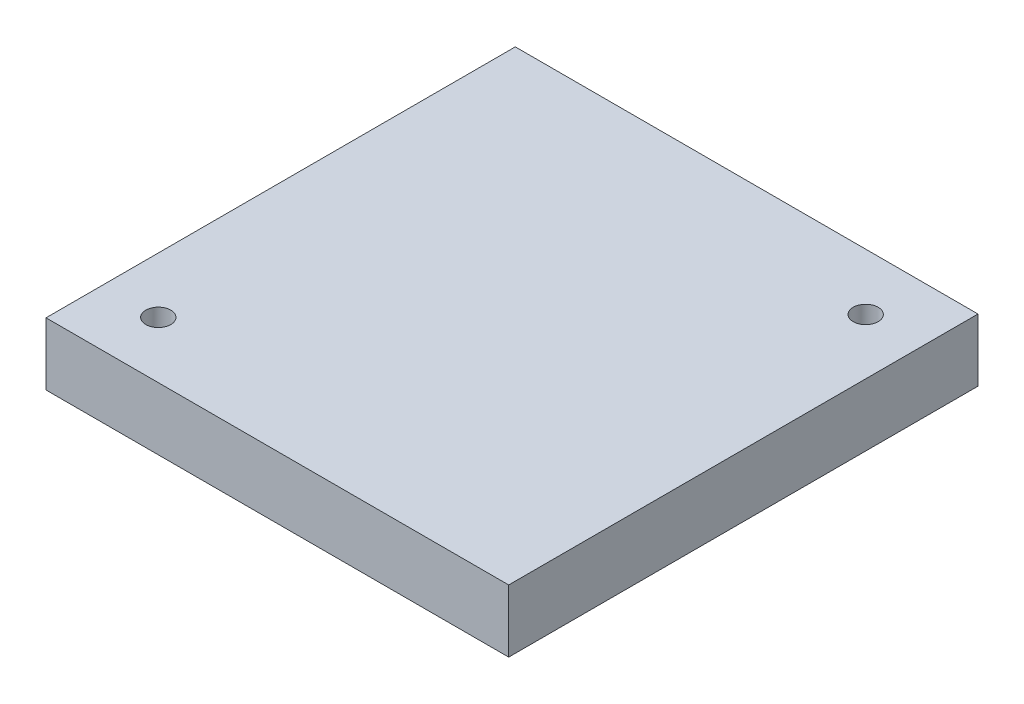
ISO-10303-21;
HEADER;
FILE_DESCRIPTION(('STEP AP214'),'2;1');
FILE_NAME('part.step','',(''),(''),'','','');
FILE_SCHEMA(('AUTOMOTIVE_DESIGN { 1 0 10303 214 1 1 1 1 }'));
ENDSEC;
DATA;
#1=APPLICATION_CONTEXT('core data for automotive mechanical design processes');
#2=APPLICATION_PROTOCOL_DEFINITION('international standard','automotive_design',2000,#1);
#3=PRODUCT_CONTEXT('',#1,'mechanical');
#4=PRODUCT('Part','Part','',(#3));
#5=PRODUCT_RELATED_PRODUCT_CATEGORY('part','',(#4));
#6=PRODUCT_DEFINITION_FORMATION('','',#4);
#7=PRODUCT_DEFINITION_CONTEXT('part definition',#1,'design');
#8=PRODUCT_DEFINITION('design','',#6,#7);
#9=PRODUCT_DEFINITION_SHAPE('','',#8);
#10=(LENGTH_UNIT() NAMED_UNIT(*) SI_UNIT(.MILLI.,.METRE.));
#11=(NAMED_UNIT(*) PLANE_ANGLE_UNIT() SI_UNIT($,.RADIAN.));
#12=(NAMED_UNIT(*) SI_UNIT($,.STERADIAN.) SOLID_ANGLE_UNIT());
#13=UNCERTAINTY_MEASURE_WITH_UNIT(LENGTH_MEASURE(1.E-05),#10,'distance_accuracy_value','');
#14=(GEOMETRIC_REPRESENTATION_CONTEXT(3) GLOBAL_UNCERTAINTY_ASSIGNED_CONTEXT((#13)) GLOBAL_UNIT_ASSIGNED_CONTEXT((#10,
#11,#12)) REPRESENTATION_CONTEXT('',''));
#15=CARTESIAN_POINT('',(0.,0.,0.));
#16=DIRECTION('',(0.,0.,1.));
#17=DIRECTION('',(1.,0.,0.));
#18=AXIS2_PLACEMENT_3D('',#15,#16,#17);
#19=CARTESIAN_POINT('',(0.,0.,0.));
#20=DIRECTION('',(0.,-1.,0.));
#21=DIRECTION('',(0.,0.,-1.));
#22=AXIS2_PLACEMENT_3D('',#19,#20,#21);
#23=PLANE('',#22);
#24=DIRECTION('',(0.,0.,-1.));
#25=VECTOR('',#24,1.);
#26=CARTESIAN_POINT('',(18.5,0.,18.7638837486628));
#27=LINE('',#26,#25);
#28=CARTESIAN_POINT('',(18.5,0.,18.7638837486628));
#29=VERTEX_POINT('',#28);
#30=CARTESIAN_POINT('',(18.5,0.,-18.7638837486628));
#31=VERTEX_POINT('',#30);
#32=EDGE_CURVE('E148',#29,#31,#27,.T.);
#33=ORIENTED_EDGE('',*,*,#32,.F.);
#34=DIRECTION('',(1.,0.,0.));
#35=VECTOR('',#34,1.);
#36=CARTESIAN_POINT('',(-18.5,0.,18.7638837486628));
#37=LINE('',#36,#35);
#38=CARTESIAN_POINT('',(-18.5,0.,18.7638837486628));
#39=VERTEX_POINT('',#38);
#40=EDGE_CURVE('E158',#39,#29,#37,.T.);
#41=ORIENTED_EDGE('',*,*,#40,.F.);
#42=DIRECTION('',(0.,0.,1.));
#43=VECTOR('',#42,1.);
#44=CARTESIAN_POINT('',(-18.5,0.,18.7638837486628));
#45=LINE('',#44,#43);
#46=CARTESIAN_POINT('',(-18.5,0.,-18.7638837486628));
#47=VERTEX_POINT('',#46);
#48=EDGE_CURVE('E155',#47,#39,#45,.T.);
#49=ORIENTED_EDGE('',*,*,#48,.F.);
#50=DIRECTION('',(-1.,0.,0.));
#51=VECTOR('',#50,1.);
#52=CARTESIAN_POINT('',(-18.5,0.,-18.7638837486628));
#53=LINE('',#52,#51);
#54=EDGE_CURVE('E152',#31,#47,#53,.T.);
#55=ORIENTED_EDGE('',*,*,#54,.F.);
#56=EDGE_LOOP('',(#33,#41,#49,#55));
#57=FACE_BOUND('',#56,.T.);
#58=DIRECTION('',(1.,0.,0.));
#59=VECTOR('',#58,1.);
#60=CARTESIAN_POINT('',(0.,0.,16.7638837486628));
#61=LINE('',#60,#59);
#62=CARTESIAN_POINT('',(-16.5,0.,16.7638837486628));
#63=VERTEX_POINT('',#62);
#64=CARTESIAN_POINT('',(16.5,0.,16.7638837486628));
#65=VERTEX_POINT('',#64);
#66=EDGE_CURVE('E132',#63,#65,#61,.T.);
#67=ORIENTED_EDGE('',*,*,#66,.T.);
#68=DIRECTION('',(0.,0.,-1.));
#69=VECTOR('',#68,1.);
#70=CARTESIAN_POINT('',(16.5,0.,0.));
#71=LINE('',#70,#69);
#72=CARTESIAN_POINT('',(16.5,0.,-16.7638837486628));
#73=VERTEX_POINT('',#72);
#74=EDGE_CURVE('E137',#65,#73,#71,.T.);
#75=ORIENTED_EDGE('',*,*,#74,.T.);
#76=DIRECTION('',(-1.,0.,0.));
#77=VECTOR('',#76,1.);
#78=CARTESIAN_POINT('',(0.,0.,-16.7638837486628));
#79=LINE('',#78,#77);
#80=CARTESIAN_POINT('',(-16.5,0.,-16.7638837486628));
#81=VERTEX_POINT('',#80);
#82=EDGE_CURVE('E120',#73,#81,#79,.T.);
#83=ORIENTED_EDGE('',*,*,#82,.T.);
#84=DIRECTION('',(0.,0.,1.));
#85=VECTOR('',#84,1.);
#86=CARTESIAN_POINT('',(-16.5,0.,0.));
#87=LINE('',#86,#85);
#88=EDGE_CURVE('E50',#81,#63,#87,.T.);
#89=ORIENTED_EDGE('',*,*,#88,.T.);
#90=EDGE_LOOP('',(#67,#75,#83,#89));
#91=FACE_BOUND('',#90,.T.);
#92=ADVANCED_FACE('F33',(#57,#91),#23,.T.);
#93=CARTESIAN_POINT('',(18.5,14.,18.7638837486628));
#94=DIRECTION('',(-1.,0.,0.));
#95=DIRECTION('',(0.,0.,1.));
#96=AXIS2_PLACEMENT_3D('',#93,#94,#95);
#97=PLANE('',#96);
#98=DIRECTION('',(0.,-1.,0.));
#99=VECTOR('',#98,1.);
#100=CARTESIAN_POINT('',(18.5,14.,-18.7638837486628));
#101=LINE('',#100,#99);
#102=CARTESIAN_POINT('',(18.5,5.00000000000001,-18.7638837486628));
#103=VERTEX_POINT('',#102);
#104=EDGE_CURVE('E11',#103,#31,#101,.T.);
#105=ORIENTED_EDGE('',*,*,#104,.F.);
#106=DIRECTION('',(0.,0.,1.));
#107=VECTOR('',#106,1.);
#108=CARTESIAN_POINT('',(18.5,5.00000000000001,-18.7638837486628));
#109=LINE('',#108,#107);
#110=CARTESIAN_POINT('',(18.5,5.,18.7638837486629));
#111=VERTEX_POINT('',#110);
#112=EDGE_CURVE('E124',#103,#111,#109,.T.);
#113=ORIENTED_EDGE('',*,*,#112,.T.);
#114=DIRECTION('',(0.,-1.,0.));
#115=VECTOR('',#114,1.);
#116=CARTESIAN_POINT('',(18.5,14.,18.7638837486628));
#117=LINE('',#116,#115);
#118=EDGE_CURVE('E161',#111,#29,#117,.T.);
#119=ORIENTED_EDGE('',*,*,#118,.T.);
#120=ORIENTED_EDGE('',*,*,#32,.T.);
#121=EDGE_LOOP('',(#105,#113,#119,#120));
#122=FACE_BOUND('',#121,.T.);
#123=ADVANCED_FACE('F35',(#122),#97,.F.);
#124=CARTESIAN_POINT('',(-18.5,14.,-18.7638837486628));
#125=DIRECTION('',(0.,0.,1.));
#126=DIRECTION('',(1.,0.,0.));
#127=AXIS2_PLACEMENT_3D('',#124,#125,#126);
#128=PLANE('',#127);
#129=DIRECTION('',(0.,-1.,0.));
#130=VECTOR('',#129,1.);
#131=CARTESIAN_POINT('',(-18.5,14.,-18.7638837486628));
#132=LINE('',#131,#130);
#133=CARTESIAN_POINT('',(-18.5,5.00000000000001,-18.7638837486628));
#134=VERTEX_POINT('',#133);
#135=EDGE_CURVE('E42',#134,#47,#132,.T.);
#136=ORIENTED_EDGE('',*,*,#135,.F.);
#137=DIRECTION('',(-1.,0.,0.));
#138=VECTOR('',#137,1.);
#139=CARTESIAN_POINT('',(18.5,5.00000000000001,-18.7638837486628));
#140=LINE('',#139,#138);
#141=EDGE_CURVE('E144',#103,#134,#140,.T.);
#142=ORIENTED_EDGE('',*,*,#141,.F.);
#143=ORIENTED_EDGE('',*,*,#104,.T.);
#144=ORIENTED_EDGE('',*,*,#54,.T.);
#145=EDGE_LOOP('',(#136,#142,#143,#144));
#146=FACE_BOUND('',#145,.T.);
#147=ADVANCED_FACE('F199',(#146),#128,.F.);
#148=CARTESIAN_POINT('',(-18.5,14.,18.7638837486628));
#149=DIRECTION('',(1.,0.,0.));
#150=DIRECTION('',(0.,0.,-1.));
#151=AXIS2_PLACEMENT_3D('',#148,#149,#150);
#152=PLANE('',#151);
#153=DIRECTION('',(0.,-1.,0.));
#154=VECTOR('',#153,1.);
#155=CARTESIAN_POINT('',(-18.5,14.,18.7638837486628));
#156=LINE('',#155,#154);
#157=CARTESIAN_POINT('',(-18.5,5.,18.7638837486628));
#158=VERTEX_POINT('',#157);
#159=EDGE_CURVE('E163',#158,#39,#156,.T.);
#160=ORIENTED_EDGE('',*,*,#159,.F.);
#161=DIRECTION('',(0.,0.,1.));
#162=VECTOR('',#161,1.);
#163=CARTESIAN_POINT('',(-18.5,5.00000000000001,-18.7638837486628));
#164=LINE('',#163,#162);
#165=EDGE_CURVE('E58',#134,#158,#164,.T.);
#166=ORIENTED_EDGE('',*,*,#165,.F.);
#167=ORIENTED_EDGE('',*,*,#135,.T.);
#168=ORIENTED_EDGE('',*,*,#48,.T.);
#169=EDGE_LOOP('',(#160,#166,#167,#168));
#170=FACE_BOUND('',#169,.T.);
#171=ADVANCED_FACE('F189',(#170),#152,.F.);
#172=CARTESIAN_POINT('',(-18.5,14.,18.7638837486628));
#173=DIRECTION('',(0.,0.,-1.));
#174=DIRECTION('',(-1.,0.,0.));
#175=AXIS2_PLACEMENT_3D('',#172,#173,#174);
#176=PLANE('',#175);
#177=ORIENTED_EDGE('',*,*,#118,.F.);
#178=DIRECTION('',(-1.,0.,0.));
#179=VECTOR('',#178,1.);
#180=CARTESIAN_POINT('',(18.5,5.,18.7638837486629));
#181=LINE('',#180,#179);
#182=EDGE_CURVE('E146',#111,#158,#181,.T.);
#183=ORIENTED_EDGE('',*,*,#182,.T.);
#184=ORIENTED_EDGE('',*,*,#159,.T.);
#185=ORIENTED_EDGE('',*,*,#40,.T.);
#186=EDGE_LOOP('',(#177,#183,#184,#185));
#187=FACE_BOUND('',#186,.T.);
#188=ADVANCED_FACE('F181',(#187),#176,.F.);
#189=CARTESIAN_POINT('',(18.5,5.00000000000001,-18.7638837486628));
#190=DIRECTION('',(0.,-1.,0.));
#191=DIRECTION('',(0.,0.,-1.));
#192=AXIS2_PLACEMENT_3D('',#189,#190,#191);
#193=PLANE('',#192);
#194=CARTESIAN_POINT('',(-14.0416361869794,5.,14.2419258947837));
#195=DIRECTION('',(0.,1.,0.));
#196=DIRECTION('',(0.,0.,1.));
#197=AXIS2_PLACEMENT_3D('',#194,#195,#196);
#198=CIRCLE('',#197,1.);
#199=CARTESIAN_POINT('',(-14.0416361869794,5.,15.2419258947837));
#200=VERTEX_POINT('',#199);
#201=EDGE_CURVE('E167',#200,#200,#198,.T.);
#202=ORIENTED_EDGE('',*,*,#201,.F.);
#203=EDGE_LOOP('',(#202));
#204=FACE_BOUND('',#203,.T.);
#205=CARTESIAN_POINT('',(14.0416361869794,5.,-14.2419258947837));
#206=DIRECTION('',(0.,1.,0.));
#207=DIRECTION('',(0.,0.,1.));
#208=AXIS2_PLACEMENT_3D('',#205,#206,#207);
#209=CIRCLE('',#208,1.);
#210=CARTESIAN_POINT('',(14.0416361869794,5.,-13.2419258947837));
#211=VERTEX_POINT('',#210);
#212=EDGE_CURVE('E129',#211,#211,#209,.T.);
#213=ORIENTED_EDGE('',*,*,#212,.F.);
#214=EDGE_LOOP('',(#213));
#215=FACE_BOUND('',#214,.T.);
#216=ORIENTED_EDGE('',*,*,#165,.T.);
#217=ORIENTED_EDGE('',*,*,#182,.F.);
#218=ORIENTED_EDGE('',*,*,#112,.F.);
#219=ORIENTED_EDGE('',*,*,#141,.T.);
#220=EDGE_LOOP('',(#216,#217,#218,#219));
#221=FACE_BOUND('',#220,.T.);
#222=ADVANCED_FACE('F179',(#204,#215,#221),#193,.F.);
#223=CARTESIAN_POINT('',(16.5,14.,18.7638837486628));
#224=DIRECTION('',(-1.,0.,0.));
#225=DIRECTION('',(0.,0.,1.));
#226=AXIS2_PLACEMENT_3D('',#223,#224,#225);
#227=PLANE('',#226);
#228=DIRECTION('',(0.,-1.,0.));
#229=VECTOR('',#228,1.);
#230=CARTESIAN_POINT('',(16.5,14.,-16.7638837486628));
#231=LINE('',#230,#229);
#232=CARTESIAN_POINT('',(16.5,3.00000000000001,-16.7638837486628));
#233=VERTEX_POINT('',#232);
#234=EDGE_CURVE('E105',#233,#73,#231,.T.);
#235=ORIENTED_EDGE('',*,*,#234,.T.);
#236=ORIENTED_EDGE('',*,*,#74,.F.);
#237=DIRECTION('',(0.,-1.,0.));
#238=VECTOR('',#237,1.);
#239=CARTESIAN_POINT('',(16.5,14.,16.7638837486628));
#240=LINE('',#239,#238);
#241=CARTESIAN_POINT('',(16.5,3.,16.7638837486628));
#242=VERTEX_POINT('',#241);
#243=EDGE_CURVE('E107',#242,#65,#240,.T.);
#244=ORIENTED_EDGE('',*,*,#243,.F.);
#245=DIRECTION('',(0.,0.,1.));
#246=VECTOR('',#245,1.);
#247=CARTESIAN_POINT('',(16.5,3.,18.7638837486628));
#248=LINE('',#247,#246);
#249=EDGE_CURVE('E100',#233,#242,#248,.T.);
#250=ORIENTED_EDGE('',*,*,#249,.F.);
#251=EDGE_LOOP('',(#235,#236,#244,#250));
#252=FACE_BOUND('',#251,.T.);
#253=ADVANCED_FACE('F102',(#252),#227,.T.);
#254=CARTESIAN_POINT('',(-18.5,14.,-16.7638837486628));
#255=DIRECTION('',(0.,0.,1.));
#256=DIRECTION('',(1.,0.,0.));
#257=AXIS2_PLACEMENT_3D('',#254,#255,#256);
#258=PLANE('',#257);
#259=DIRECTION('',(0.,-1.,0.));
#260=VECTOR('',#259,1.);
#261=CARTESIAN_POINT('',(-16.5,14.,-16.7638837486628));
#262=LINE('',#261,#260);
#263=CARTESIAN_POINT('',(-16.5,3.00000000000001,-16.7638837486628));
#264=VERTEX_POINT('',#263);
#265=EDGE_CURVE('E122',#264,#81,#262,.T.);
#266=ORIENTED_EDGE('',*,*,#265,.T.);
#267=ORIENTED_EDGE('',*,*,#82,.F.);
#268=ORIENTED_EDGE('',*,*,#234,.F.);
#269=DIRECTION('',(-1.,0.,0.));
#270=VECTOR('',#269,1.);
#271=CARTESIAN_POINT('',(18.5,3.00000000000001,-16.7638837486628));
#272=LINE('',#271,#270);
#273=EDGE_CURVE('E110',#233,#264,#272,.T.);
#274=ORIENTED_EDGE('',*,*,#273,.T.);
#275=EDGE_LOOP('',(#266,#267,#268,#274));
#276=FACE_BOUND('',#275,.T.);
#277=ADVANCED_FACE('F118',(#276),#258,.T.);
#278=CARTESIAN_POINT('',(-16.5,14.,18.7638837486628));
#279=DIRECTION('',(1.,0.,0.));
#280=DIRECTION('',(0.,0.,-1.));
#281=AXIS2_PLACEMENT_3D('',#278,#279,#280);
#282=PLANE('',#281);
#283=DIRECTION('',(0.,-1.,0.));
#284=VECTOR('',#283,1.);
#285=CARTESIAN_POINT('',(-16.5,14.,16.7638837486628));
#286=LINE('',#285,#284);
#287=CARTESIAN_POINT('',(-16.5,3.,16.7638837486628));
#288=VERTEX_POINT('',#287);
#289=EDGE_CURVE('E126',#288,#63,#286,.T.);
#290=ORIENTED_EDGE('',*,*,#289,.T.);
#291=ORIENTED_EDGE('',*,*,#88,.F.);
#292=ORIENTED_EDGE('',*,*,#265,.F.);
#293=DIRECTION('',(0.,0.,1.));
#294=VECTOR('',#293,1.);
#295=CARTESIAN_POINT('',(-16.5,3.00000000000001,-18.7638837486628));
#296=LINE('',#295,#294);
#297=EDGE_CURVE('E111',#264,#288,#296,.T.);
#298=ORIENTED_EDGE('',*,*,#297,.T.);
#299=EDGE_LOOP('',(#290,#291,#292,#298));
#300=FACE_BOUND('',#299,.T.);
#301=ADVANCED_FACE('F248',(#300),#282,.T.);
#302=CARTESIAN_POINT('',(-18.5,14.,16.7638837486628));
#303=DIRECTION('',(0.,0.,-1.));
#304=DIRECTION('',(-1.,0.,0.));
#305=AXIS2_PLACEMENT_3D('',#302,#303,#304);
#306=PLANE('',#305);
#307=ORIENTED_EDGE('',*,*,#243,.T.);
#308=ORIENTED_EDGE('',*,*,#66,.F.);
#309=ORIENTED_EDGE('',*,*,#289,.F.);
#310=DIRECTION('',(-1.,0.,0.));
#311=VECTOR('',#310,1.);
#312=CARTESIAN_POINT('',(-18.5,3.,16.7638837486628));
#313=LINE('',#312,#311);
#314=EDGE_CURVE('E116',#242,#288,#313,.T.);
#315=ORIENTED_EDGE('',*,*,#314,.F.);
#316=EDGE_LOOP('',(#307,#308,#309,#315));
#317=FACE_BOUND('',#316,.T.);
#318=ADVANCED_FACE('F257',(#317),#306,.T.);
#319=CARTESIAN_POINT('',(18.5,3.00000000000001,-18.7638837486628));
#320=DIRECTION('',(0.,-1.,0.));
#321=DIRECTION('',(0.,0.,-1.));
#322=AXIS2_PLACEMENT_3D('',#319,#320,#321);
#323=PLANE('',#322);
#324=CARTESIAN_POINT('',(-14.0416361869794,3.,14.2419258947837));
#325=DIRECTION('',(0.,-1.,0.));
#326=DIRECTION('',(0.,0.,-1.));
#327=AXIS2_PLACEMENT_3D('',#324,#325,#326);
#328=CIRCLE('',#327,1.);
#329=CARTESIAN_POINT('',(-14.0416361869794,3.,13.2419258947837));
#330=VERTEX_POINT('',#329);
#331=EDGE_CURVE('E37',#330,#330,#328,.T.);
#332=ORIENTED_EDGE('',*,*,#331,.F.);
#333=EDGE_LOOP('',(#332));
#334=FACE_BOUND('',#333,.T.);
#335=CARTESIAN_POINT('',(14.0416361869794,3.00000000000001,-14.2419258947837));
#336=DIRECTION('',(0.,-1.,0.));
#337=DIRECTION('',(0.,0.,-1.));
#338=AXIS2_PLACEMENT_3D('',#335,#336,#337);
#339=CIRCLE('',#338,1.);
#340=CARTESIAN_POINT('',(14.0416361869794,3.00000000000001,-15.2419258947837));
#341=VERTEX_POINT('',#340);
#342=EDGE_CURVE('E165',#341,#341,#339,.T.);
#343=ORIENTED_EDGE('',*,*,#342,.F.);
#344=EDGE_LOOP('',(#343));
#345=FACE_BOUND('',#344,.T.);
#346=ORIENTED_EDGE('',*,*,#297,.F.);
#347=ORIENTED_EDGE('',*,*,#273,.F.);
#348=ORIENTED_EDGE('',*,*,#249,.T.);
#349=ORIENTED_EDGE('',*,*,#314,.T.);
#350=EDGE_LOOP('',(#346,#347,#348,#349));
#351=FACE_BOUND('',#350,.T.);
#352=ADVANCED_FACE('F114',(#334,#345,#351),#323,.T.);
#353=CARTESIAN_POINT('',(14.0416361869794,-21.,-14.2419258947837));
#354=DIRECTION('',(0.,1.,0.));
#355=DIRECTION('',(0.,0.,1.));
#356=AXIS2_PLACEMENT_3D('',#353,#354,#355);
#357=CYLINDRICAL_SURFACE('',#356,1.);
#358=ORIENTED_EDGE('',*,*,#342,.T.);
#359=EDGE_LOOP('',(#358));
#360=FACE_BOUND('',#359,.T.);
#361=ORIENTED_EDGE('',*,*,#212,.T.);
#362=EDGE_LOOP('',(#361));
#363=FACE_BOUND('',#362,.T.);
#364=ADVANCED_FACE('F177',(#360,#363),#357,.F.);
#365=CARTESIAN_POINT('',(-14.0416361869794,-21.,14.2419258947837));
#366=DIRECTION('',(0.,1.,0.));
#367=DIRECTION('',(0.,0.,1.));
#368=AXIS2_PLACEMENT_3D('',#365,#366,#367);
#369=CYLINDRICAL_SURFACE('',#368,1.);
#370=ORIENTED_EDGE('',*,*,#331,.T.);
#371=EDGE_LOOP('',(#370));
#372=FACE_BOUND('',#371,.T.);
#373=ORIENTED_EDGE('',*,*,#201,.T.);
#374=EDGE_LOOP('',(#373));
#375=FACE_BOUND('',#374,.T.);
#376=ADVANCED_FACE('F286',(#372,#375),#369,.F.);
#377=CLOSED_SHELL('',(#92,#123,#147,#171,#188,#222,#253,#277,#301,#318,#352,#364,#376));
#378=MANIFOLD_SOLID_BREP('B2',#377);
#379=ADVANCED_BREP_SHAPE_REPRESENTATION('',(#18,#378),#14);
#380=SHAPE_DEFINITION_REPRESENTATION(#9,#379);
ENDSEC;
END-ISO-10303-21;
